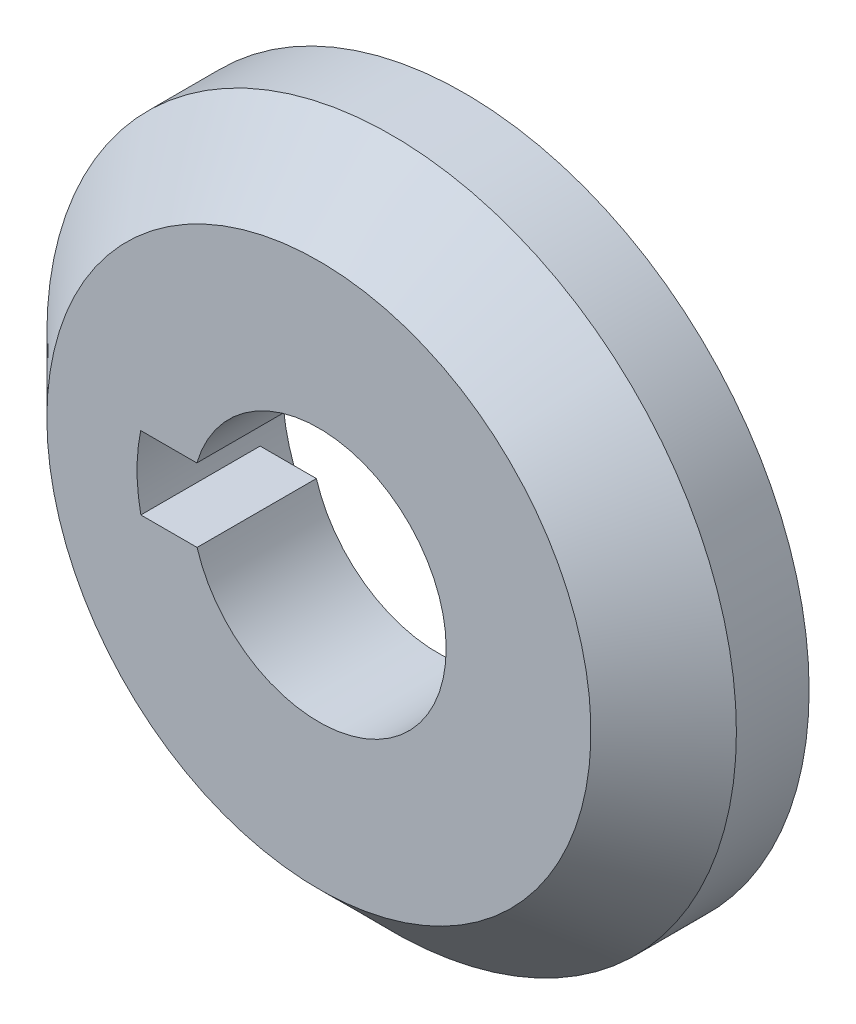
ISO-10303-21;
HEADER;
FILE_DESCRIPTION(('STEP AP214'),'2;1');
FILE_NAME('part.step','',(''),(''),'','','');
FILE_SCHEMA(('AUTOMOTIVE_DESIGN { 1 0 10303 214 1 1 1 1 }'));
ENDSEC;
DATA;
#1=APPLICATION_CONTEXT('core data for automotive mechanical design processes');
#2=APPLICATION_PROTOCOL_DEFINITION('international standard','automotive_design',2000,#1);
#3=PRODUCT_CONTEXT('',#1,'mechanical');
#4=PRODUCT('Part','Part','',(#3));
#5=PRODUCT_RELATED_PRODUCT_CATEGORY('part','',(#4));
#6=PRODUCT_DEFINITION_FORMATION('','',#4);
#7=PRODUCT_DEFINITION_CONTEXT('part definition',#1,'design');
#8=PRODUCT_DEFINITION('design','',#6,#7);
#9=PRODUCT_DEFINITION_SHAPE('','',#8);
#10=(LENGTH_UNIT() NAMED_UNIT(*) SI_UNIT(.MILLI.,.METRE.));
#11=(NAMED_UNIT(*) PLANE_ANGLE_UNIT() SI_UNIT($,.RADIAN.));
#12=(NAMED_UNIT(*) SI_UNIT($,.STERADIAN.) SOLID_ANGLE_UNIT());
#13=UNCERTAINTY_MEASURE_WITH_UNIT(LENGTH_MEASURE(1.E-05),#10,'distance_accuracy_value','');
#14=(GEOMETRIC_REPRESENTATION_CONTEXT(3) GLOBAL_UNCERTAINTY_ASSIGNED_CONTEXT((#13)) GLOBAL_UNIT_ASSIGNED_CONTEXT((#10,
#11,#12)) REPRESENTATION_CONTEXT('',''));
#15=CARTESIAN_POINT('',(0.,0.,0.));
#16=DIRECTION('',(0.,0.,1.));
#17=DIRECTION('',(1.,0.,0.));
#18=AXIS2_PLACEMENT_3D('',#15,#16,#17);
#19=CARTESIAN_POINT('',(0.,0.,0.));
#20=DIRECTION('',(0.,0.,1.));
#21=DIRECTION('',(1.,0.,0.));
#22=AXIS2_PLACEMENT_3D('',#19,#20,#21);
#23=CYLINDRICAL_SURFACE('',#22,7.4083333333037);
#24=CARTESIAN_POINT('',(0.,0.,1.5239999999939));
#25=DIRECTION('',(0.,0.,1.));
#26=DIRECTION('',(1.,0.,0.));
#27=AXIS2_PLACEMENT_3D('',#24,#25,#26);
#28=CIRCLE('',#27,7.4083333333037);
#29=CARTESIAN_POINT('',(-7.10454239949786,2.09973333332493,1.5239999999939));
#30=VERTEX_POINT('',#29);
#31=CARTESIAN_POINT('',(-7.08933065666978,-2.15053333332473,1.5239999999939));
#32=VERTEX_POINT('',#31);
#33=EDGE_CURVE('E68',#30,#32,#28,.F.);
#34=ORIENTED_EDGE('',*,*,#33,.T.);
#35=DIRECTION('',(0.,0.,-1.));
#36=VECTOR('',#35,1.);
#37=CARTESIAN_POINT('',(-7.08933065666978,-2.15053333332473,0.));
#38=LINE('',#37,#36);
#39=CARTESIAN_POINT('',(-7.08933065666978,-2.15053333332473,8.4666666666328));
#40=VERTEX_POINT('',#39);
#41=EDGE_CURVE('E66',#32,#40,#38,.F.);
#42=ORIENTED_EDGE('',*,*,#41,.T.);
#43=CARTESIAN_POINT('',(0.,0.,8.4666666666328));
#44=DIRECTION('',(0.,0.,1.));
#45=DIRECTION('',(1.,0.,0.));
#46=AXIS2_PLACEMENT_3D('',#43,#44,#45);
#47=CIRCLE('',#46,7.4083333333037);
#48=CARTESIAN_POINT('',(-7.10454239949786,2.09973333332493,8.4666666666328));
#49=VERTEX_POINT('',#48);
#50=EDGE_CURVE('E55',#49,#40,#47,.F.);
#51=ORIENTED_EDGE('',*,*,#50,.F.);
#52=DIRECTION('',(0.,0.,1.));
#53=VECTOR('',#52,1.);
#54=CARTESIAN_POINT('',(-7.10454239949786,2.09973333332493,0.));
#55=LINE('',#54,#53);
#56=EDGE_CURVE('E74',#49,#30,#55,.F.);
#57=ORIENTED_EDGE('',*,*,#56,.T.);
#58=EDGE_LOOP('',(#34,#42,#51,#57));
#59=FACE_BOUND('',#58,.T.);
#60=ADVANCED_FACE('F17',(#59),#23,.F.);
#61=CARTESIAN_POINT('',(0.,0.,4.2333333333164));
#62=DIRECTION('',(0.,0.,-1.));
#63=DIRECTION('',(-1.,0.,0.));
#64=AXIS2_PLACEMENT_3D('',#61,#62,#63);
#65=CONICAL_SURFACE('',#64,20.0659999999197,0.785398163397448);
#66=CARTESIAN_POINT('',(0.,0.,4.2333333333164));
#67=DIRECTION('',(0.,0.,1.));
#68=DIRECTION('',(1.,0.,0.));
#69=AXIS2_PLACEMENT_3D('',#66,#67,#68);
#70=CIRCLE('',#69,20.0659999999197);
#71=CARTESIAN_POINT('',(20.0659999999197,0.,4.2333333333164));
#72=VERTEX_POINT('',#71);
#73=EDGE_CURVE('E78',#72,#72,#70,.F.);
#74=ORIENTED_EDGE('',*,*,#73,.F.);
#75=EDGE_LOOP('',(#74));
#76=FACE_BOUND('',#75,.T.);
#77=CARTESIAN_POINT('',(0.,0.,8.4666666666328));
#78=DIRECTION('',(0.,0.,-1.));
#79=DIRECTION('',(-1.,0.,0.));
#80=AXIS2_PLACEMENT_3D('',#77,#78,#79);
#81=CIRCLE('',#80,15.8326666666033);
#82=CARTESIAN_POINT('',(-15.8326666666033,0.,8.4666666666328));
#83=VERTEX_POINT('',#82);
#84=EDGE_CURVE('E20',#83,#83,#81,.F.);
#85=ORIENTED_EDGE('',*,*,#84,.F.);
#86=EDGE_LOOP('',(#85));
#87=FACE_BOUND('',#86,.T.);
#88=ADVANCED_FACE('F167',(#76,#87),#65,.T.);
#89=CARTESIAN_POINT('',(-7.08933065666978,-2.15053333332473,0.));
#90=DIRECTION('',(0.,-1.,0.));
#91=DIRECTION('',(0.,0.,-1.));
#92=AXIS2_PLACEMENT_3D('',#89,#90,#91);
#93=PLANE('',#92);
#94=DIRECTION('',(1.,0.,0.));
#95=VECTOR('',#94,1.);
#96=CARTESIAN_POINT('',(0.,-2.15053333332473,1.5239999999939));
#97=LINE('',#96,#95);
#98=CARTESIAN_POINT('',(-10.3625359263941,-2.15053333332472,1.5239999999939));
#99=VERTEX_POINT('',#98);
#100=EDGE_CURVE('E80',#32,#99,#97,.F.);
#101=ORIENTED_EDGE('',*,*,#100,.T.);
#102=DIRECTION('',(0.,0.,1.));
#103=VECTOR('',#102,1.);
#104=CARTESIAN_POINT('',(-10.3625359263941,-2.15053333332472,0.));
#105=LINE('',#104,#103);
#106=CARTESIAN_POINT('',(-10.3625359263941,-2.15053333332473,8.4666666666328));
#107=VERTEX_POINT('',#106);
#108=EDGE_CURVE('E35',#99,#107,#105,.T.);
#109=ORIENTED_EDGE('',*,*,#108,.T.);
#110=DIRECTION('',(1.,0.,0.));
#111=VECTOR('',#110,1.);
#112=CARTESIAN_POINT('',(0.,-2.15053333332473,8.4666666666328));
#113=LINE('',#112,#111);
#114=EDGE_CURVE('E63',#40,#107,#113,.F.);
#115=ORIENTED_EDGE('',*,*,#114,.F.);
#116=ORIENTED_EDGE('',*,*,#41,.F.);
#117=EDGE_LOOP('',(#101,#109,#115,#116));
#118=FACE_BOUND('',#117,.T.);
#119=ADVANCED_FACE('F72',(#118),#93,.F.);
#120=CARTESIAN_POINT('',(0.,0.,8.4666666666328));
#121=DIRECTION('',(0.,0.,1.));
#122=DIRECTION('',(1.,0.,0.));
#123=AXIS2_PLACEMENT_3D('',#120,#121,#122);
#124=PLANE('',#123);
#125=ORIENTED_EDGE('',*,*,#114,.T.);
#126=CARTESIAN_POINT('',(0.,0.,8.4666666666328));
#127=DIRECTION('',(0.,0.,1.));
#128=DIRECTION('',(1.,0.,0.));
#129=AXIS2_PLACEMENT_3D('',#126,#127,#128);
#130=CIRCLE('',#129,10.583333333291);
#131=CARTESIAN_POINT('',(-10.3729486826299,2.09973333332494,8.4666666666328));
#132=VERTEX_POINT('',#131);
#133=EDGE_CURVE('E90',#107,#132,#130,.F.);
#134=ORIENTED_EDGE('',*,*,#133,.T.);
#135=DIRECTION('',(1.,0.,0.));
#136=VECTOR('',#135,1.);
#137=CARTESIAN_POINT('',(-10.3729486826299,2.09973333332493,8.4666666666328));
#138=LINE('',#137,#136);
#139=EDGE_CURVE('E64',#132,#49,#138,.T.);
#140=ORIENTED_EDGE('',*,*,#139,.T.);
#141=ORIENTED_EDGE('',*,*,#50,.T.);
#142=EDGE_LOOP('',(#125,#134,#140,#141));
#143=FACE_BOUND('',#142,.T.);
#144=ORIENTED_EDGE('',*,*,#84,.T.);
#145=EDGE_LOOP('',(#144));
#146=FACE_BOUND('',#145,.T.);
#147=ADVANCED_FACE('F59',(#143,#146),#124,.T.);
#148=CARTESIAN_POINT('',(-10.3729486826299,2.09973333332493,0.));
#149=DIRECTION('',(0.,1.,0.));
#150=DIRECTION('',(0.,0.,1.));
#151=AXIS2_PLACEMENT_3D('',#148,#149,#150);
#152=PLANE('',#151);
#153=DIRECTION('',(1.,0.,0.));
#154=VECTOR('',#153,1.);
#155=CARTESIAN_POINT('',(0.,2.09973333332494,1.5239999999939));
#156=LINE('',#155,#154);
#157=CARTESIAN_POINT('',(-10.3729486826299,2.09973333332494,1.5239999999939));
#158=VERTEX_POINT('',#157);
#159=EDGE_CURVE('E82',#158,#30,#156,.T.);
#160=ORIENTED_EDGE('',*,*,#159,.T.);
#161=ORIENTED_EDGE('',*,*,#56,.F.);
#162=ORIENTED_EDGE('',*,*,#139,.F.);
#163=DIRECTION('',(0.,0.,1.));
#164=VECTOR('',#163,1.);
#165=CARTESIAN_POINT('',(-10.3729486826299,2.09973333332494,0.));
#166=LINE('',#165,#164);
#167=EDGE_CURVE('E89',#132,#158,#166,.F.);
#168=ORIENTED_EDGE('',*,*,#167,.T.);
#169=EDGE_LOOP('',(#160,#161,#162,#168));
#170=FACE_BOUND('',#169,.T.);
#171=ADVANCED_FACE('F100',(#170),#152,.F.);
#172=CARTESIAN_POINT('',(0.,0.,1.5239999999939));
#173=DIRECTION('',(0.,0.,1.));
#174=DIRECTION('',(1.,0.,0.));
#175=AXIS2_PLACEMENT_3D('',#172,#173,#174);
#176=PLANE('',#175);
#177=CARTESIAN_POINT('',(0.,0.,1.5239999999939));
#178=DIRECTION('',(0.,0.,1.));
#179=DIRECTION('',(1.,0.,0.));
#180=AXIS2_PLACEMENT_3D('',#177,#178,#179);
#181=CIRCLE('',#180,10.583333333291);
#182=EDGE_CURVE('E86',#158,#99,#181,.F.);
#183=ORIENTED_EDGE('',*,*,#182,.T.);
#184=ORIENTED_EDGE('',*,*,#100,.F.);
#185=ORIENTED_EDGE('',*,*,#33,.F.);
#186=ORIENTED_EDGE('',*,*,#159,.F.);
#187=EDGE_LOOP('',(#183,#184,#185,#186));
#188=FACE_BOUND('',#187,.T.);
#189=ADVANCED_FACE('F103',(#188),#176,.F.);
#190=CARTESIAN_POINT('',(0.,0.,0.));
#191=DIRECTION('',(0.,0.,1.));
#192=DIRECTION('',(1.,0.,0.));
#193=AXIS2_PLACEMENT_3D('',#190,#191,#192);
#194=CYLINDRICAL_SURFACE('',#193,20.0659999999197);
#195=ORIENTED_EDGE('',*,*,#73,.T.);
#196=EDGE_LOOP('',(#195));
#197=FACE_BOUND('',#196,.T.);
#198=CARTESIAN_POINT('',(0.,0.,0.));
#199=DIRECTION('',(0.,0.,1.));
#200=DIRECTION('',(1.,0.,0.));
#201=AXIS2_PLACEMENT_3D('',#198,#199,#200);
#202=CIRCLE('',#201,20.0659999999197);
#203=CARTESIAN_POINT('',(20.0659999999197,0.,0.));
#204=VERTEX_POINT('',#203);
#205=EDGE_CURVE('E26',#204,#204,#202,.T.);
#206=ORIENTED_EDGE('',*,*,#205,.T.);
#207=EDGE_LOOP('',(#206));
#208=FACE_BOUND('',#207,.T.);
#209=ADVANCED_FACE('F105',(#197,#208),#194,.T.);
#210=CARTESIAN_POINT('',(0.,0.,0.));
#211=DIRECTION('',(0.,0.,1.));
#212=DIRECTION('',(1.,0.,0.));
#213=AXIS2_PLACEMENT_3D('',#210,#211,#212);
#214=CYLINDRICAL_SURFACE('',#213,10.583333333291);
#215=CARTESIAN_POINT('',(0.,0.,0.));
#216=DIRECTION('',(0.,0.,1.));
#217=DIRECTION('',(1.,0.,0.));
#218=AXIS2_PLACEMENT_3D('',#215,#216,#217);
#219=CIRCLE('',#218,10.583333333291);
#220=CARTESIAN_POINT('',(10.583333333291,0.,0.));
#221=VERTEX_POINT('',#220);
#222=EDGE_CURVE('E11',#221,#221,#219,.F.);
#223=ORIENTED_EDGE('',*,*,#222,.T.);
#224=EDGE_LOOP('',(#223));
#225=FACE_BOUND('',#224,.T.);
#226=ORIENTED_EDGE('',*,*,#182,.F.);
#227=ORIENTED_EDGE('',*,*,#167,.F.);
#228=ORIENTED_EDGE('',*,*,#133,.F.);
#229=ORIENTED_EDGE('',*,*,#108,.F.);
#230=EDGE_LOOP('',(#226,#227,#228,#229));
#231=FACE_BOUND('',#230,.T.);
#232=ADVANCED_FACE('F101',(#225,#231),#214,.F.);
#233=CARTESIAN_POINT('',(0.,0.,0.));
#234=DIRECTION('',(0.,0.,1.));
#235=DIRECTION('',(1.,0.,0.));
#236=AXIS2_PLACEMENT_3D('',#233,#234,#235);
#237=PLANE('',#236);
#238=ORIENTED_EDGE('',*,*,#222,.F.);
#239=EDGE_LOOP('',(#238));
#240=FACE_BOUND('',#239,.T.);
#241=ORIENTED_EDGE('',*,*,#205,.F.);
#242=EDGE_LOOP('',(#241));
#243=FACE_BOUND('',#242,.T.);
#244=ADVANCED_FACE('F115',(#240,#243),#237,.F.);
#245=CLOSED_SHELL('',(#60,#88,#119,#147,#171,#189,#209,#232,#244));
#246=MANIFOLD_SOLID_BREP('B1',#245);
#247=ADVANCED_BREP_SHAPE_REPRESENTATION('',(#18,#246),#14);
#248=SHAPE_DEFINITION_REPRESENTATION(#9,#247);
ENDSEC;
END-ISO-10303-21;
